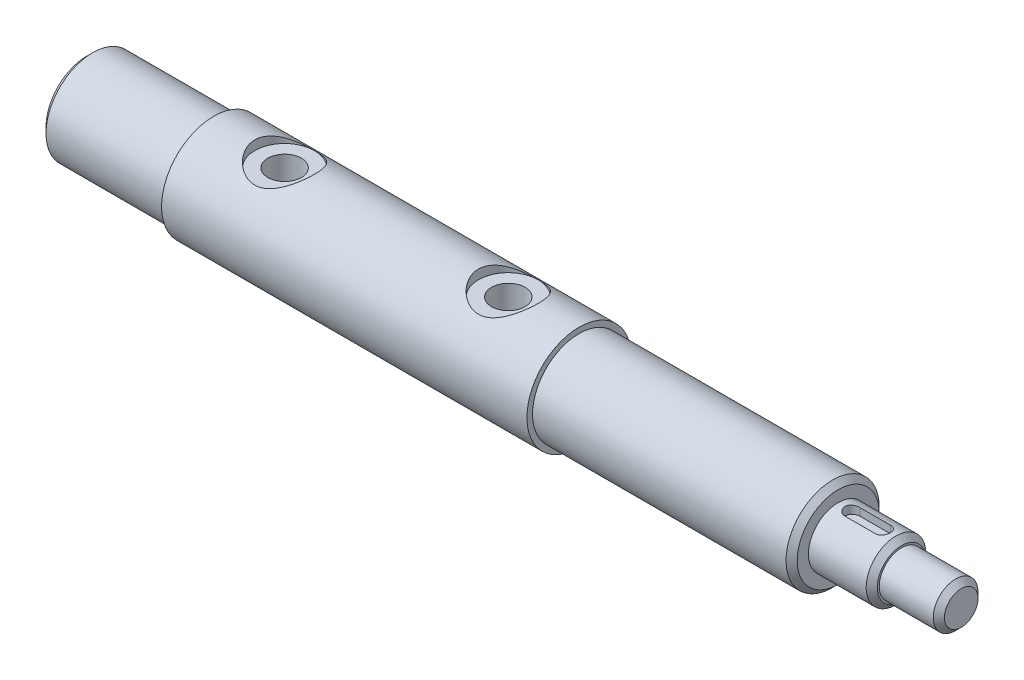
from build123d import *

# Parameters (mm, degrees)
ESQUISSE2_R             = 8
ENL_V_MAT_EXTRU_1_DEPTH = 2.5
ESQUISSE3_R             = 4.5
ENL_V_MAT_EXTRU_2_DEPTH = 138.609956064
CHANFREIN1_SIZE         = 1.5
ENL_V_MAT_EXTRU_3_DEPTH = 2.25


with BuildPart() as part:
    # Esquisse1 → R_volution1 (revolve)
    with BuildSketch(Plane.XY):
        Polygon((-100, 12.5), (-100, 0), (134.5, 0), (134.5, 6), (118.5, 6), (118.5, 8), (101.5, 8), (101.5, 12.5), (32, 12.5), (32, 14), (-66, 14), (-66, 12.5), align=None)
    revolve(axis=Axis((-100, 0, 0), (-1, 0, 0)))

    # Esquisse2 → Enl_v. mat.-Extru.1 (cut)
    with BuildSketch(Plane(origin=(0, 14, 0), x_dir=(-1, 0, 0), z_dir=(0, 1, 0))):
        with Locations((47, 0)):
            Circle(ESQUISSE2_R)
        with Locations((-13, 0)):
            Circle(ESQUISSE2_R)
    extrude(amount=-ENL_V_MAT_EXTRU_1_DEPTH, mode=Mode.SUBTRACT)

    # Esquisse3 → Enl_v. mat.-Extru.2 (cut, through all)
    with BuildSketch(Plane(origin=(0, 11.5, 0), x_dir=(-1, 0, 0), z_dir=(0, 1, 0))):
        with Locations(Location((-13, 0, 0), (0, 0, 90))):
            Circle(ESQUISSE3_R)
        with Locations(Location((47, 0, 0), (0, 0, 90))):
            Circle(ESQUISSE3_R)
    extrude(amount=-ENL_V_MAT_EXTRU_2_DEPTH, mode=Mode.SUBTRACT)

    # Chanfrein1
    chanfrein1_edges = [part.edges().sort_by_distance(p)[0] for p in [
        (-100, -12.5, 0),
        (101.5, -12.5, 0),
        (118.5, -8, 0),
        (134.5, -6, 0),
    ]]
    chamfer(chanfrein1_edges, length=CHANFREIN1_SIZE)

    # Esquisse4 → Enl_v. mat.-Extru.3 (cut)
    with BuildSketch(Plane(origin=(0, 8, 0), x_dir=(-1, 0, 0), z_dir=(0, 1, 0))):
        with BuildLine():
            Line((-113.5, 2), (-105.3, 2))
            ThreePointArc((-105.3, 2), (-103.3, 0), (-105.3, -2))
            Line((-105.3, -2), (-113.5, -2))
            ThreePointArc((-113.5, -2), (-115.5, 0), (-113.5, 2))
        make_face()
    extrude(amount=-ENL_V_MAT_EXTRU_3_DEPTH, mode=Mode.SUBTRACT)


solid = part.part
